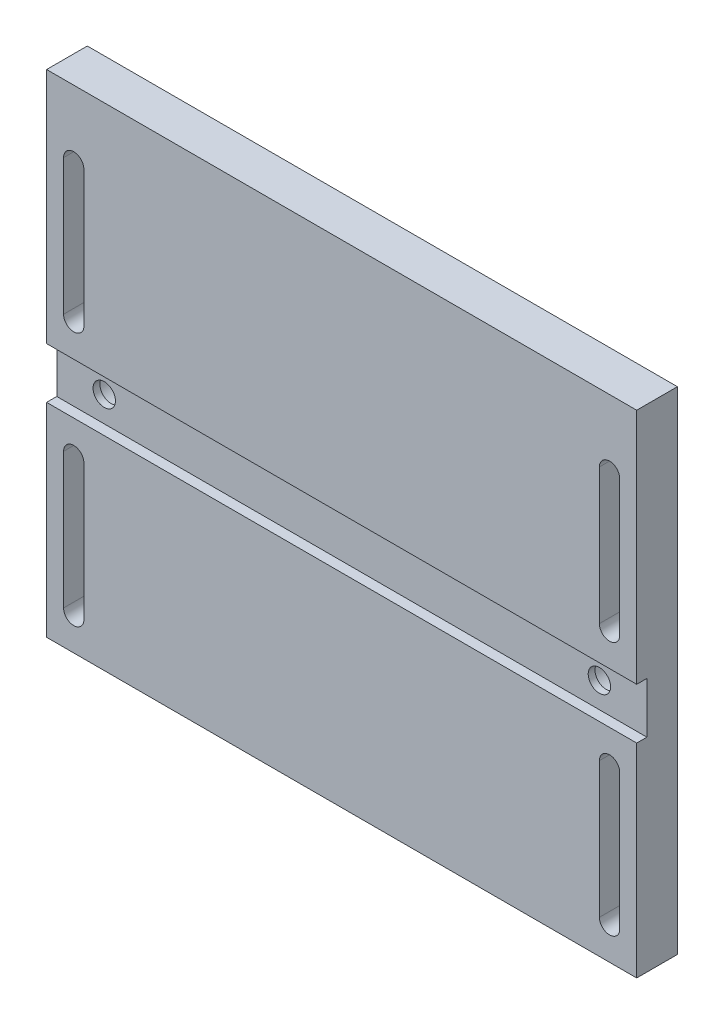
from build123d import *

# Parameters (mm, degrees)
ESQUISSE1_W                                        = 174
ESQUISSE1_H                                        = 145
EXTRUSION1_DEPTH                                   = 12
ESQUISSE2_W                                        = 174
ESQUISSE2_H                                        = 15
ENL_V_MAT_EXTRU_1_DEPTH                            = 3
CHAMBRAGE_POUR_VIS_T_TE_CYLINDRIQUE_FE_D           = 6.6
CHAMBRAGE_POUR_VIS_T_TE_CYLINDRIQUE_FE_DEPTH       = 12
CHAMBRAGE_POUR_VIS_T_TE_CYLINDRIQUE_FE_CBORE_D     = 11
CHAMBRAGE_POUR_VIS_T_TE_CYLINDRIQUE_FE_CBORE_DEPTH = 7
CHAMBRAGE_POUR_VIS_T_TE_CYLINDRIQUE_FE_TIP         = 1.982840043
ENL_V_MAT_EXTRU_2_DEPTH                            = 114.882615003
TROU_TARAUD_M6X1_01_D                              = 4.8
TROU_TARAUD_M6X1_01_DEPTH                          = 30
TROU_TARAUD_M6X1_01_TIP                            = 1.442065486


with BuildPart() as part:
    # Esquisse1 → Extrusion1 (new body)
    with BuildSketch(Plane.XY):
        Rectangle(ESQUISSE1_W, ESQUISSE1_H)
    extrude(amount=EXTRUSION1_DEPTH)

    # Esquisse2 → Enl_v. mat.-Extru.1 (cut)
    with BuildSketch(Plane.XY.offset(12)):
        with Locations((0, -5)):
            Rectangle(ESQUISSE2_W, ESQUISSE2_H)
    extrude(amount=-ENL_V_MAT_EXTRU_1_DEPTH, mode=Mode.SUBTRACT)

    # Chambrage pour vis _ t_te cylindrique fe
    with Locations(Plane(origin=(0, 0, 0), x_dir=(-1, 0, 0), z_dir=(0, 0, -1))):
        with Locations((-73, -5), (73, -5)):
            CounterBoreHole(CHAMBRAGE_POUR_VIS_T_TE_CYLINDRIQUE_FE_D / 2, CHAMBRAGE_POUR_VIS_T_TE_CYLINDRIQUE_FE_CBORE_D / 2, CHAMBRAGE_POUR_VIS_T_TE_CYLINDRIQUE_FE_CBORE_DEPTH, depth=CHAMBRAGE_POUR_VIS_T_TE_CYLINDRIQUE_FE_DEPTH)
            with Locations((0, 0, -(CHAMBRAGE_POUR_VIS_T_TE_CYLINDRIQUE_FE_DEPTH + CHAMBRAGE_POUR_VIS_T_TE_CYLINDRIQUE_FE_TIP / 2))):  # 118° drill point
                Cone(0, CHAMBRAGE_POUR_VIS_T_TE_CYLINDRIQUE_FE_D / 2, CHAMBRAGE_POUR_VIS_T_TE_CYLINDRIQUE_FE_TIP, mode=Mode.SUBTRACT)

    # Esquisse5 → Enl_v. mat.-Extru.2 (cut, through all)
    with BuildSketch(Plane(origin=(0, 0, 0), x_dir=(-1, 0, 0), z_dir=(0, 0, -1))):
        with BuildLine():
            Line((76, 52.5), (76, 12.5))
            ThreePointArc((76, 12.5), (79, 9.5), (82, 12.5))
            Line((82, 12.5), (82, 52.5))
            ThreePointArc((82, 52.5), (79, 55.5), (76, 52.5))
        make_face()
        with BuildLine():
            Line((-82, 52.5), (-82, 12.5))
            ThreePointArc((-82, 12.5), (-79, 9.5), (-76, 12.5))
            Line((-76, 12.5), (-76, 52.5))
            ThreePointArc((-76, 52.5), (-79, 55.5), (-82, 52.5))
        make_face()
        with BuildLine():
            Line((-76, -62.5), (-76, -22.5))
            ThreePointArc((-76, -22.5), (-79, -19.5), (-82, -22.5))
            Line((-82, -22.5), (-82, -62.5))
            ThreePointArc((-82, -62.5), (-79, -65.5), (-76, -62.5))
        make_face()
        with BuildLine():
            Line((82, -62.5), (82, -22.5))
            ThreePointArc((82, -22.5), (79, -19.5), (76, -22.5))
            Line((76, -22.5), (76, -62.5))
            ThreePointArc((76, -62.5), (79, -65.5), (82, -62.5))
        make_face()
    extrude(amount=-ENL_V_MAT_EXTRU_2_DEPTH, mode=Mode.SUBTRACT)

    # Trou taraud_ M6x1.01
    with Locations(Plane.XZ.offset(72.5)):
        with Locations((-17.5, 6), (17.5, 6)):
            Hole(TROU_TARAUD_M6X1_01_D / 2, depth=TROU_TARAUD_M6X1_01_DEPTH)
            with Locations((0, 0, -(TROU_TARAUD_M6X1_01_DEPTH + TROU_TARAUD_M6X1_01_TIP / 2))):  # 118° drill point
                Cone(0, TROU_TARAUD_M6X1_01_D / 2, TROU_TARAUD_M6X1_01_TIP, mode=Mode.SUBTRACT)


solid = part.part
